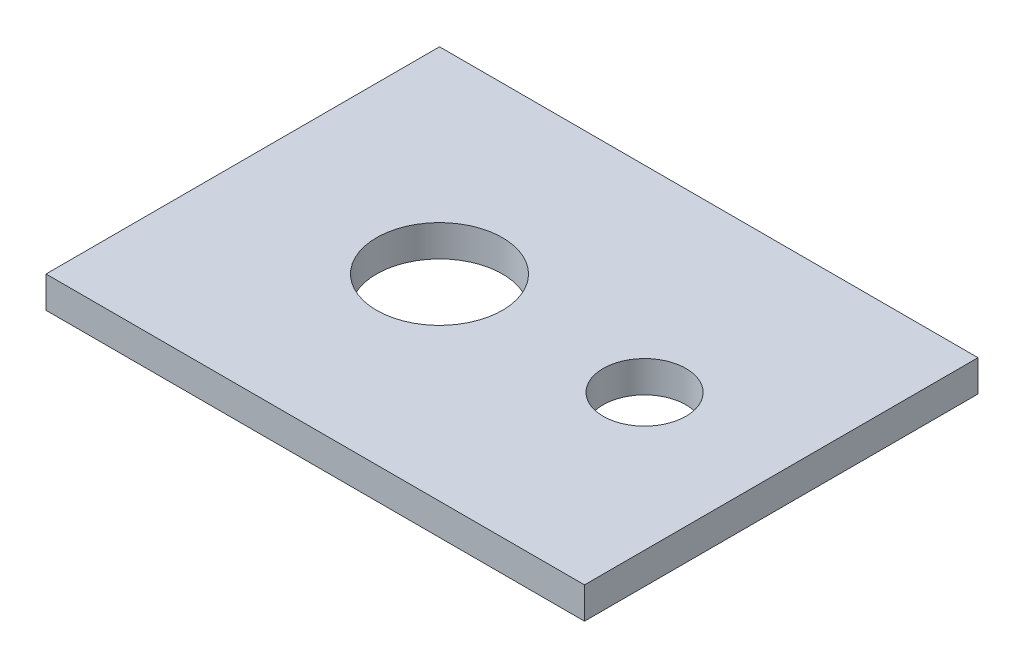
from build123d import *

# Parameters (mm, degrees)
SKETCH4_W      = 165.1
SKETCH4_H      = 120.65
SKETCH4_R      = 19.304
SKETCH4_R_2    = 12.7
EXTRUDE1_DEPTH = 9.652


with BuildPart() as part:
    # Sketch4 → Extrude1 (new body)
    with BuildSketch(Plane(origin=(0, 0, 0), x_dir=(1, 0, 0), z_dir=(0, 1, 0))):
        with Locations((82.55, 60.325)):
            Rectangle(SKETCH4_W, SKETCH4_H)
        with Locations(Location((60.325, 60.325, 0), (0, 0, 270))):
            Circle(SKETCH4_R, mode=Mode.SUBTRACT)
        with Locations(Location((123.19, 60.325, 0), (0, 0, 270))):
            Circle(SKETCH4_R_2, mode=Mode.SUBTRACT)
    extrude(amount=EXTRUDE1_DEPTH)


solid = part.part
